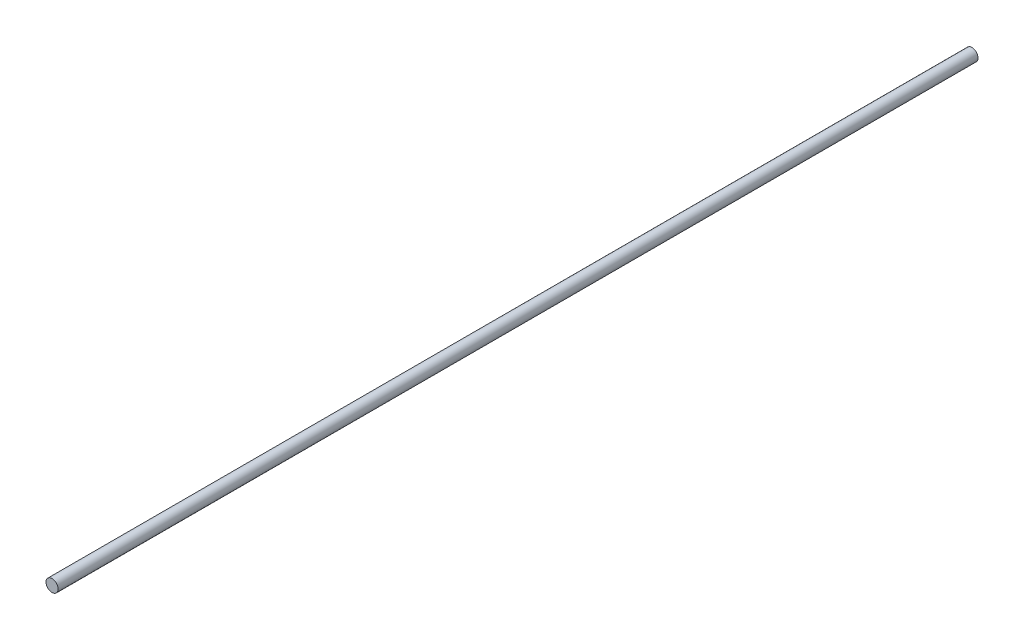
ISO-10303-21;
HEADER;
FILE_DESCRIPTION(('STEP AP214'),'2;1');
FILE_NAME('part.step','',(''),(''),'','','');
FILE_SCHEMA(('AUTOMOTIVE_DESIGN { 1 0 10303 214 1 1 1 1 }'));
ENDSEC;
DATA;
#1=APPLICATION_CONTEXT('core data for automotive mechanical design processes');
#2=APPLICATION_PROTOCOL_DEFINITION('international standard','automotive_design',2000,#1);
#3=PRODUCT_CONTEXT('',#1,'mechanical');
#4=PRODUCT('Part','Part','',(#3));
#5=PRODUCT_RELATED_PRODUCT_CATEGORY('part','',(#4));
#6=PRODUCT_DEFINITION_FORMATION('','',#4);
#7=PRODUCT_DEFINITION_CONTEXT('part definition',#1,'design');
#8=PRODUCT_DEFINITION('design','',#6,#7);
#9=PRODUCT_DEFINITION_SHAPE('','',#8);
#10=(LENGTH_UNIT() NAMED_UNIT(*) SI_UNIT(.MILLI.,.METRE.));
#11=(NAMED_UNIT(*) PLANE_ANGLE_UNIT() SI_UNIT($,.RADIAN.));
#12=(NAMED_UNIT(*) SI_UNIT($,.STERADIAN.) SOLID_ANGLE_UNIT());
#13=UNCERTAINTY_MEASURE_WITH_UNIT(LENGTH_MEASURE(1.E-05),#10,'distance_accuracy_value','');
#14=(GEOMETRIC_REPRESENTATION_CONTEXT(3) GLOBAL_UNCERTAINTY_ASSIGNED_CONTEXT((#13)) GLOBAL_UNIT_ASSIGNED_CONTEXT((#10,
#11,#12)) REPRESENTATION_CONTEXT('',''));
#15=CARTESIAN_POINT('',(0.,0.,0.));
#16=DIRECTION('',(0.,0.,1.));
#17=DIRECTION('',(1.,0.,0.));
#18=AXIS2_PLACEMENT_3D('',#15,#16,#17);
#19=CARTESIAN_POINT('',(0.,0.,-4550.));
#20=DIRECTION('',(0.,0.,1.));
#21=DIRECTION('',(1.,0.,0.));
#22=AXIS2_PLACEMENT_3D('',#19,#20,#21);
#23=CYLINDRICAL_SURFACE('',#22,30.);
#24=CARTESIAN_POINT('',(0.,0.,-4550.));
#25=DIRECTION('',(0.,0.,1.));
#26=DIRECTION('',(1.,0.,0.));
#27=AXIS2_PLACEMENT_3D('',#24,#25,#26);
#28=CIRCLE('',#27,30.);
#29=CARTESIAN_POINT('',(30.,0.,-4550.));
#30=VERTEX_POINT('',#29);
#31=EDGE_CURVE('E10',#30,#30,#28,.T.);
#32=CARTESIAN_POINT('',(0.,0.,0.));
#33=DIRECTION('',(0.,0.,1.));
#34=DIRECTION('',(1.,0.,0.));
#35=AXIS2_PLACEMENT_3D('',#32,#33,#34);
#36=CIRCLE('',#35,30.);
#37=CARTESIAN_POINT('',(30.,0.,0.));
#38=VERTEX_POINT('',#37);
#39=EDGE_CURVE('E40',#38,#38,#36,.T.);
#40=CARTESIAN_POINT('',(30.,0.,-4550.));
#41=CARTESIAN_POINT('',(30.,0.,-4502.60416666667));
#42=CARTESIAN_POINT('',(30.,0.,-4455.20833333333));
#43=CARTESIAN_POINT('',(30.,0.,-4360.41666666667));
#44=CARTESIAN_POINT('',(30.,0.,-4313.02083333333));
#45=CARTESIAN_POINT('',(30.,0.,-4218.22916666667));
#46=CARTESIAN_POINT('',(30.,0.,-4170.83333333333));
#47=CARTESIAN_POINT('',(30.,0.,-4076.04166666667));
#48=CARTESIAN_POINT('',(30.,0.,-4028.64583333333));
#49=CARTESIAN_POINT('',(30.,0.,-3933.85416666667));
#50=CARTESIAN_POINT('',(30.,0.,-3886.45833333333));
#51=CARTESIAN_POINT('',(30.,0.,-3791.66666666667));
#52=CARTESIAN_POINT('',(30.,0.,-3744.27083333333));
#53=CARTESIAN_POINT('',(30.,0.,-3649.47916666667));
#54=CARTESIAN_POINT('',(30.,0.,-3602.08333333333));
#55=CARTESIAN_POINT('',(30.,0.,-3507.29166666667));
#56=CARTESIAN_POINT('',(30.,0.,-3459.89583333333));
#57=CARTESIAN_POINT('',(30.,0.,-3365.10416666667));
#58=CARTESIAN_POINT('',(30.,0.,-3317.70833333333));
#59=CARTESIAN_POINT('',(30.,0.,-3222.91666666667));
#60=CARTESIAN_POINT('',(30.,0.,-3175.52083333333));
#61=CARTESIAN_POINT('',(30.,0.,-3080.72916666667));
#62=CARTESIAN_POINT('',(30.,0.,-3033.33333333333));
#63=CARTESIAN_POINT('',(30.,0.,-2938.54166666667));
#64=CARTESIAN_POINT('',(30.,0.,-2891.14583333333));
#65=CARTESIAN_POINT('',(30.,0.,-2796.35416666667));
#66=CARTESIAN_POINT('',(30.,0.,-2748.95833333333));
#67=CARTESIAN_POINT('',(30.,0.,-2654.16666666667));
#68=CARTESIAN_POINT('',(30.,0.,-2606.77083333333));
#69=CARTESIAN_POINT('',(30.,0.,-2511.97916666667));
#70=CARTESIAN_POINT('',(30.,0.,-2464.58333333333));
#71=CARTESIAN_POINT('',(30.,0.,-2369.79166666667));
#72=CARTESIAN_POINT('',(30.,0.,-2322.39583333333));
#73=CARTESIAN_POINT('',(30.,0.,-2227.60416666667));
#74=CARTESIAN_POINT('',(30.,0.,-2180.20833333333));
#75=CARTESIAN_POINT('',(30.,0.,-2085.41666666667));
#76=CARTESIAN_POINT('',(30.,0.,-2038.02083333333));
#77=CARTESIAN_POINT('',(30.,0.,-1943.22916666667));
#78=CARTESIAN_POINT('',(30.,0.,-1895.83333333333));
#79=CARTESIAN_POINT('',(30.,0.,-1801.04166666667));
#80=CARTESIAN_POINT('',(30.,0.,-1753.64583333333));
#81=CARTESIAN_POINT('',(30.,0.,-1658.85416666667));
#82=CARTESIAN_POINT('',(30.,0.,-1611.45833333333));
#83=CARTESIAN_POINT('',(30.,0.,-1516.66666666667));
#84=CARTESIAN_POINT('',(30.,0.,-1469.27083333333));
#85=CARTESIAN_POINT('',(30.,0.,-1374.47916666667));
#86=CARTESIAN_POINT('',(30.,0.,-1327.08333333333));
#87=CARTESIAN_POINT('',(30.,0.,-1232.29166666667));
#88=CARTESIAN_POINT('',(30.,0.,-1184.89583333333));
#89=CARTESIAN_POINT('',(30.,0.,-1090.10416666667));
#90=CARTESIAN_POINT('',(30.,0.,-1042.70833333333));
#91=CARTESIAN_POINT('',(30.,0.,-947.916666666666));
#92=CARTESIAN_POINT('',(30.,0.,-900.520833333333));
#93=CARTESIAN_POINT('',(30.,0.,-805.729166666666));
#94=CARTESIAN_POINT('',(30.,0.,-758.333333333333));
#95=CARTESIAN_POINT('',(30.,0.,-663.541666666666));
#96=CARTESIAN_POINT('',(30.,0.,-616.145833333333));
#97=CARTESIAN_POINT('',(30.,0.,-521.354166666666));
#98=CARTESIAN_POINT('',(30.,0.,-473.958333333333));
#99=CARTESIAN_POINT('',(30.,0.,-379.166666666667));
#100=CARTESIAN_POINT('',(30.,0.,-331.770833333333));
#101=CARTESIAN_POINT('',(30.,0.,-236.979166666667));
#102=CARTESIAN_POINT('',(30.,0.,-189.583333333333));
#103=CARTESIAN_POINT('',(30.,0.,-94.7916666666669));
#104=CARTESIAN_POINT('',(30.,0.,-47.3958333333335));
#105=CARTESIAN_POINT('',(30.,0.,0.));
#106=B_SPLINE_CURVE_WITH_KNOTS('',3,(#40,#41,#42,#43,#44,#45,#46,#47,#48,#49,#50,#51,#52,#53,
#54,#55,#56,#57,#58,#59,#60,#61,#62,#63,#64,#65,#66,#67,#68,#69,#70,#71,#72,#73,#74,#75,#76,#77,
#78,#79,#80,#81,#82,#83,#84,#85,#86,#87,#88,#89,#90,#91,#92,#93,#94,#95,#96,#97,#98,#99,#100,
#101,#102,#103,#104,#105),.UNSPECIFIED.,.F.,.F.,(4,2,2,2,2,2,2,2,2,2,2,2,2,2,2,2,2,2,2,2,2,2,2,
2,2,2,2,2,2,2,2,2,4),(0.,142.1875,284.375000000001,426.5625,568.750000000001,710.9375,
853.125000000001,995.312500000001,1137.5,1279.6875,1421.875,1564.0625,1706.25,1848.4375,
1990.625,2132.8125,2275.,2417.1875,2559.375,2701.5625,2843.75,2985.9375,3128.125,3270.3125,
3412.5,3554.6875,3696.875,3839.0625,3981.25,4123.4375,4265.625,4407.8125,4550.),.UNSPECIFIED.);
#107=EDGE_CURVE('BSEAM37',#30,#38,#106,.T.);
#108=ORIENTED_EDGE('',*,*,#31,.T.);
#109=ORIENTED_EDGE('',*,*,#39,.F.);
#110=ORIENTED_EDGE('',*,*,#107,.T.);
#111=ORIENTED_EDGE('',*,*,#107,.F.);
#112=EDGE_LOOP('',(#108,#110,#109,#111));
#113=FACE_BOUND('',#112,.T.);
#114=ADVANCED_FACE('F37',(#113),#23,.T.);
#115=CARTESIAN_POINT('',(0.,0.,-4550.));
#116=DIRECTION('',(0.,0.,1.));
#117=DIRECTION('',(1.,0.,0.));
#118=AXIS2_PLACEMENT_3D('',#115,#116,#117);
#119=PLANE('',#118);
#120=ORIENTED_EDGE('',*,*,#31,.F.);
#121=EDGE_LOOP('',(#120));
#122=FACE_BOUND('',#121,.T.);
#123=ADVANCED_FACE('F54',(#122),#119,.F.);
#124=CARTESIAN_POINT('',(0.,0.,0.));
#125=DIRECTION('',(0.,0.,1.));
#126=DIRECTION('',(1.,0.,0.));
#127=AXIS2_PLACEMENT_3D('',#124,#125,#126);
#128=PLANE('',#127);
#129=ORIENTED_EDGE('',*,*,#39,.T.);
#130=EDGE_LOOP('',(#129));
#131=FACE_BOUND('',#130,.T.);
#132=ADVANCED_FACE('F51',(#131),#128,.T.);
#133=CLOSED_SHELL('',(#114,#123,#132));
#134=MANIFOLD_SOLID_BREP('B2',#133);
#135=ADVANCED_BREP_SHAPE_REPRESENTATION('',(#18,#134),#14);
#136=SHAPE_DEFINITION_REPRESENTATION(#9,#135);
ENDSEC;
END-ISO-10303-21;
